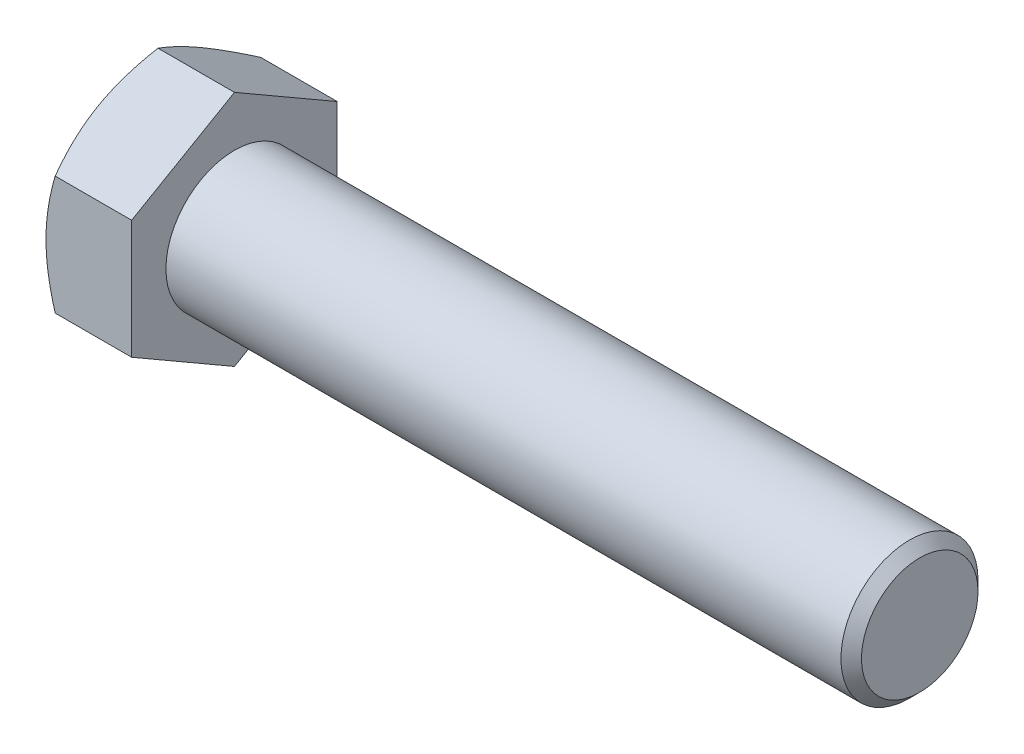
from build123d import *

# Parameters (mm, degrees)
SKETCH5_R           = 6.35
BOSS_EXTRUDE3_DEPTH = 63.5
CHAMFER1_SIZE       = 0.9525
BOSS_EXTRUDE4_DEPTH = 7.9375
SKETCH8_OUTSIDE_W   = 292.488
SKETCH8_OUTSIDE_H   = 295.436
SKETCH8_OUTSIDE_R   = 9.525
CUT_EXTRUDE3_DEPTH  = 73.904111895
CUT_EXTRUDE3_DRAFT  = -60
CUT_EXTRUDE4_DEPTH  = 0.254
CIRPATTERN1_COUNT   = 6


with BuildPart() as part:
    # Sketch5 → Boss-Extrude3 (new body)
    with BuildSketch(Plane(origin=(35.71875, 0, 0), x_dir=(0, 0, -1), z_dir=(1, 0, 0))):
        Circle(SKETCH5_R)
    extrude(amount=-BOSS_EXTRUDE3_DEPTH)

    # Chamfer1
    chamfer1_edges = [part.edges().sort_by_distance(p)[0] for p in [
        (35.71875, 0, 6.35),
    ]]
    chamfer(chamfer1_edges, length=CHAMFER1_SIZE)

    # Sketch11 → Revolve1 (revolve)
    with BuildSketch(Plane.XY):
        Polygon((-27.78125, 6.35), (-27.78125, 0), (10.31875, 0), (3.96875, 6.35), align=None)
    revolve(axis=Axis((-27.78125, 0, 0), (1, 0, 0)))

    # Sketch6 → Boss-Extrude4 (add)
    with BuildSketch(Plane.ZY.offset(27.78125)):
        Polygon((9.525, 5.499261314), (0, 10.998522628), (-9.525, 5.499261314), (-9.525, -5.499261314), (0, -10.998522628), (9.525, -5.499261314), align=None)
    extrude(amount=BOSS_EXTRUDE4_DEPTH)


with BuildPart() as cut_extrude3_tool:
    # Sketch8 outside → Cut-Extrude3 (with draft: the straight prism first)
    with BuildSketch(Plane.ZY.offset(35.71875)):
        Rectangle(SKETCH8_OUTSIDE_W, SKETCH8_OUTSIDE_H)
        Circle(SKETCH8_OUTSIDE_R, mode=Mode.SUBTRACT)
    extrude(amount=-CUT_EXTRUDE3_DEPTH)
    # Cut-Extrude3: the draft: its side faces are tilted about the plane it starts from
    cut_extrude3_sides = [cut_extrude3_tool.faces().sort_by_distance(p)[0] for p in [
        (1.233305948, -147.718, 0),
        (1.233305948, 0, 146.244),
        (1.233305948, 147.718, 0),
        (1.233305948, 0, -146.244),
        (1.233305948, 0, -9.525),
    ]]
    draft(cut_extrude3_sides, Plane.ZY.offset(35.71875), CUT_EXTRUDE3_DRAFT)


with BuildPart() as part_1:
    add(part.part)

    # Cut-Extrude3: cut by cut_extrude3_tool
    add(cut_extrude3_tool.part, mode=Mode.SUBTRACT)

    # Sketch12 → Cut-Extrude4 (cut)
    with BuildSketch(Plane.ZY.offset(35.71875)):
        with BuildLine():
            Line((0.28575, 7.33425), (0.28575, 4.09575))
            ThreePointArc((0.28575, 4.09575), (0, 3.81), (-0.28575, 4.09575))
            Line((-0.28575, 4.09575), (-0.28575, 7.33425))
            ThreePointArc((-0.28575, 7.33425), (0, 7.62), (0.28575, 7.33425))
        make_face()
    cut_extrude4 = extrude(amount=-CUT_EXTRUDE4_DEPTH, mode=Mode.SUBTRACT)

    # CirPattern1: Cut-Extrude4 ×6 about axis
    cirpattern1_axis = Axis((0, 0, 0), (1, 0, 0))
    for i in range(1, CIRPATTERN1_COUNT):
        add(cut_extrude4.rotate(cirpattern1_axis, i * 360 / CIRPATTERN1_COUNT), mode=Mode.SUBTRACT)


solid = part_1.part
